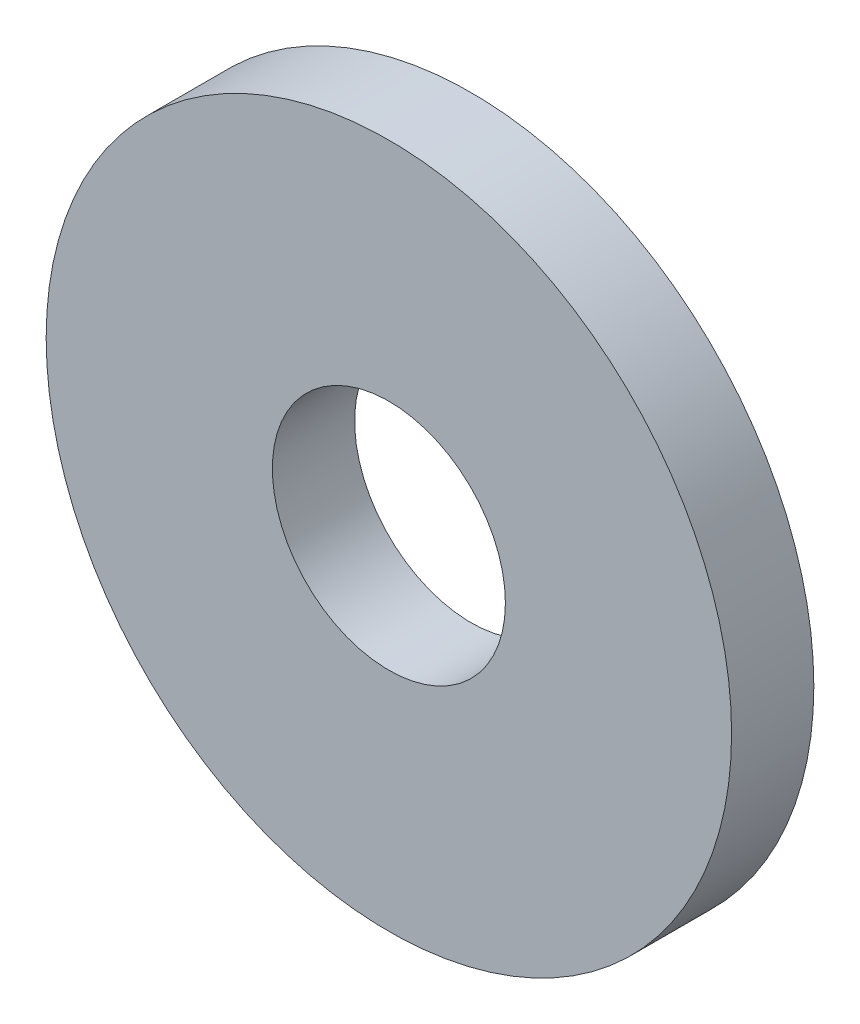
ISO-10303-21;
HEADER;
FILE_DESCRIPTION(('STEP AP214'),'2;1');
FILE_NAME('part.step','',(''),(''),'','','');
FILE_SCHEMA(('AUTOMOTIVE_DESIGN { 1 0 10303 214 1 1 1 1 }'));
ENDSEC;
DATA;
#1=APPLICATION_CONTEXT('core data for automotive mechanical design processes');
#2=APPLICATION_PROTOCOL_DEFINITION('international standard','automotive_design',2000,#1);
#3=PRODUCT_CONTEXT('',#1,'mechanical');
#4=PRODUCT('Part','Part','',(#3));
#5=PRODUCT_RELATED_PRODUCT_CATEGORY('part','',(#4));
#6=PRODUCT_DEFINITION_FORMATION('','',#4);
#7=PRODUCT_DEFINITION_CONTEXT('part definition',#1,'design');
#8=PRODUCT_DEFINITION('design','',#6,#7);
#9=PRODUCT_DEFINITION_SHAPE('','',#8);
#10=(LENGTH_UNIT() NAMED_UNIT(*) SI_UNIT(.MILLI.,.METRE.));
#11=(NAMED_UNIT(*) PLANE_ANGLE_UNIT() SI_UNIT($,.RADIAN.));
#12=(NAMED_UNIT(*) SI_UNIT($,.STERADIAN.) SOLID_ANGLE_UNIT());
#13=UNCERTAINTY_MEASURE_WITH_UNIT(LENGTH_MEASURE(1.E-05),#10,'distance_accuracy_value','');
#14=(GEOMETRIC_REPRESENTATION_CONTEXT(3) GLOBAL_UNCERTAINTY_ASSIGNED_CONTEXT((#13)) GLOBAL_UNIT_ASSIGNED_CONTEXT((#10,
#11,#12)) REPRESENTATION_CONTEXT('',''));
#15=CARTESIAN_POINT('',(0.,0.,0.));
#16=DIRECTION('',(0.,0.,1.));
#17=DIRECTION('',(1.,0.,0.));
#18=AXIS2_PLACEMENT_3D('',#15,#16,#17);
#19=CARTESIAN_POINT('',(0.,0.,0.6));
#20=DIRECTION('',(0.,0.,1.));
#21=DIRECTION('',(1.,0.,0.));
#22=AXIS2_PLACEMENT_3D('',#19,#20,#21);
#23=PLANE('',#22);
#24=CARTESIAN_POINT('',(0.,0.,0.6));
#25=DIRECTION('',(0.,0.,1.));
#26=DIRECTION('',(1.,0.,0.));
#27=AXIS2_PLACEMENT_3D('',#24,#25,#26);
#28=CIRCLE('',#27,2.5);
#29=CARTESIAN_POINT('',(2.5,0.,0.6));
#30=VERTEX_POINT('',#29);
#31=EDGE_CURVE('E10',#30,#30,#28,.T.);
#32=ORIENTED_EDGE('',*,*,#31,.T.);
#33=EDGE_LOOP('',(#32));
#34=FACE_BOUND('',#33,.T.);
#35=CARTESIAN_POINT('',(0.,0.,0.6));
#36=DIRECTION('',(0.,0.,1.));
#37=DIRECTION('',(1.,0.,0.));
#38=AXIS2_PLACEMENT_3D('',#35,#36,#37);
#39=CIRCLE('',#38,0.85);
#40=CARTESIAN_POINT('',(0.85,0.,0.6));
#41=VERTEX_POINT('',#40);
#42=EDGE_CURVE('E35',#41,#41,#39,.T.);
#43=ORIENTED_EDGE('',*,*,#42,.F.);
#44=EDGE_LOOP('',(#43));
#45=FACE_BOUND('',#44,.T.);
#46=ADVANCED_FACE('F24',(#34,#45),#23,.T.);
#47=CARTESIAN_POINT('',(0.,0.,0.));
#48=DIRECTION('',(0.,0.,1.));
#49=DIRECTION('',(1.,0.,0.));
#50=AXIS2_PLACEMENT_3D('',#47,#48,#49);
#51=PLANE('',#50);
#52=CARTESIAN_POINT('',(0.,0.,0.));
#53=DIRECTION('',(0.,0.,1.));
#54=DIRECTION('',(1.,0.,0.));
#55=AXIS2_PLACEMENT_3D('',#52,#53,#54);
#56=CIRCLE('',#55,2.5);
#57=CARTESIAN_POINT('',(2.5,0.,0.));
#58=VERTEX_POINT('',#57);
#59=EDGE_CURVE('E31',#58,#58,#56,.T.);
#60=ORIENTED_EDGE('',*,*,#59,.F.);
#61=EDGE_LOOP('',(#60));
#62=FACE_BOUND('',#61,.T.);
#63=CARTESIAN_POINT('',(0.,0.,0.));
#64=DIRECTION('',(0.,0.,1.));
#65=DIRECTION('',(1.,0.,0.));
#66=AXIS2_PLACEMENT_3D('',#63,#64,#65);
#67=CIRCLE('',#66,0.85);
#68=CARTESIAN_POINT('',(0.85,0.,0.));
#69=VERTEX_POINT('',#68);
#70=EDGE_CURVE('E39',#69,#69,#67,.T.);
#71=ORIENTED_EDGE('',*,*,#70,.T.);
#72=EDGE_LOOP('',(#71));
#73=FACE_BOUND('',#72,.T.);
#74=ADVANCED_FACE('F45',(#62,#73),#51,.F.);
#75=CARTESIAN_POINT('',(0.,0.,0.6));
#76=DIRECTION('',(0.,0.,-1.));
#77=DIRECTION('',(-1.,0.,0.));
#78=AXIS2_PLACEMENT_3D('',#75,#76,#77);
#79=CYLINDRICAL_SURFACE('',#78,2.5);
#80=ORIENTED_EDGE('',*,*,#31,.F.);
#81=EDGE_LOOP('',(#80));
#82=FACE_BOUND('',#81,.T.);
#83=ORIENTED_EDGE('',*,*,#59,.T.);
#84=EDGE_LOOP('',(#83));
#85=FACE_BOUND('',#84,.T.);
#86=ADVANCED_FACE('F26',(#82,#85),#79,.T.);
#87=CARTESIAN_POINT('',(0.,0.,0.6));
#88=DIRECTION('',(0.,0.,-1.));
#89=DIRECTION('',(-1.,0.,0.));
#90=AXIS2_PLACEMENT_3D('',#87,#88,#89);
#91=CYLINDRICAL_SURFACE('',#90,0.85);
#92=ORIENTED_EDGE('',*,*,#42,.T.);
#93=EDGE_LOOP('',(#92));
#94=FACE_BOUND('',#93,.T.);
#95=ORIENTED_EDGE('',*,*,#70,.F.);
#96=EDGE_LOOP('',(#95));
#97=FACE_BOUND('',#96,.T.);
#98=ADVANCED_FACE('F47',(#94,#97),#91,.F.);
#99=CLOSED_SHELL('',(#46,#74,#86,#98));
#100=MANIFOLD_SOLID_BREP('B2',#99);
#101=ADVANCED_BREP_SHAPE_REPRESENTATION('',(#18,#100),#14);
#102=SHAPE_DEFINITION_REPRESENTATION(#9,#101);
ENDSEC;
END-ISO-10303-21;
